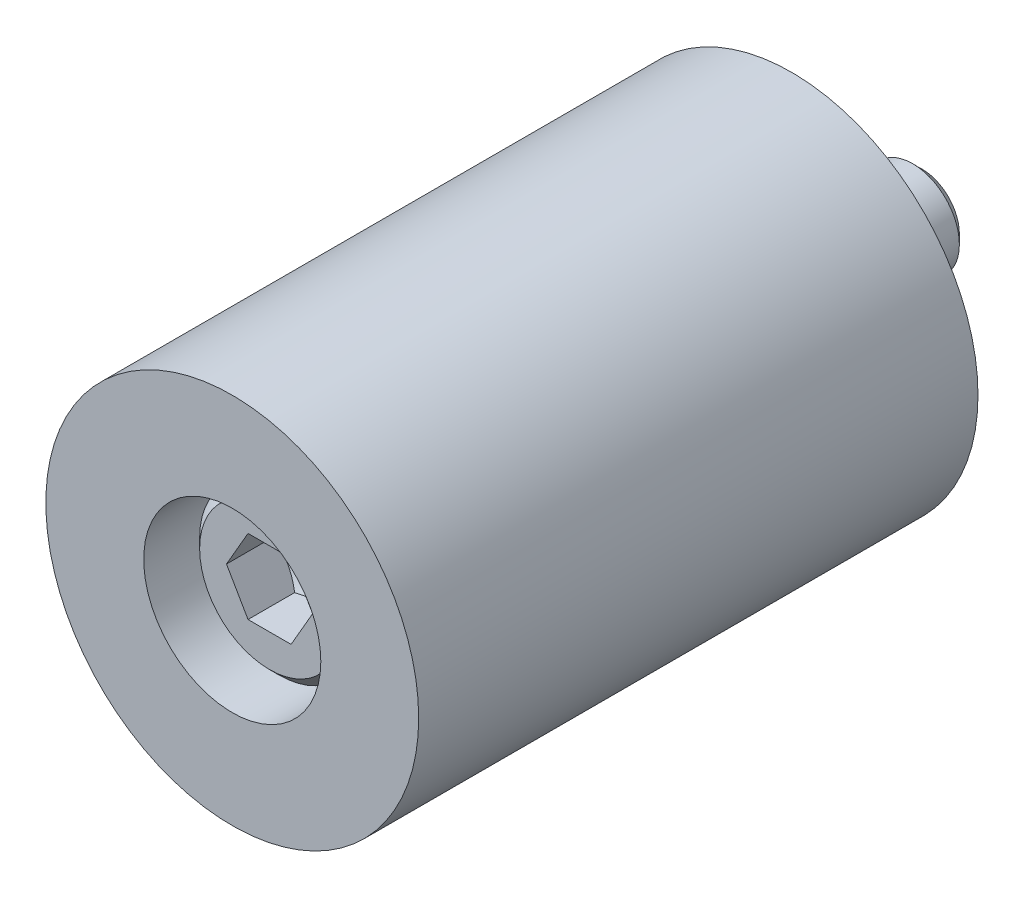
ISO-10303-21;
HEADER;
FILE_DESCRIPTION(('STEP AP214'),'2;1');
FILE_NAME('part.step','',(''),(''),'','','');
FILE_SCHEMA(('AUTOMOTIVE_DESIGN { 1 0 10303 214 1 1 1 1 }'));
ENDSEC;
DATA;
#1=APPLICATION_CONTEXT('core data for automotive mechanical design processes');
#2=APPLICATION_PROTOCOL_DEFINITION('international standard','automotive_design',2000,#1);
#3=PRODUCT_CONTEXT('',#1,'mechanical');
#4=PRODUCT('Part','Part','',(#3));
#5=PRODUCT_RELATED_PRODUCT_CATEGORY('part','',(#4));
#6=PRODUCT_DEFINITION_FORMATION('','',#4);
#7=PRODUCT_DEFINITION_CONTEXT('part definition',#1,'design');
#8=PRODUCT_DEFINITION('design','',#6,#7);
#9=PRODUCT_DEFINITION_SHAPE('','',#8);
#10=(LENGTH_UNIT() NAMED_UNIT(*) SI_UNIT(.MILLI.,.METRE.));
#11=(NAMED_UNIT(*) PLANE_ANGLE_UNIT() SI_UNIT($,.RADIAN.));
#12=(NAMED_UNIT(*) SI_UNIT($,.STERADIAN.) SOLID_ANGLE_UNIT());
#13=UNCERTAINTY_MEASURE_WITH_UNIT(LENGTH_MEASURE(1.E-05),#10,'distance_accuracy_value','');
#14=(GEOMETRIC_REPRESENTATION_CONTEXT(3) GLOBAL_UNCERTAINTY_ASSIGNED_CONTEXT((#13)) GLOBAL_UNIT_ASSIGNED_CONTEXT((#10,
#11,#12)) REPRESENTATION_CONTEXT('',''));
#15=CARTESIAN_POINT('',(0.,0.,0.));
#16=DIRECTION('',(0.,0.,1.));
#17=DIRECTION('',(1.,0.,0.));
#18=AXIS2_PLACEMENT_3D('',#15,#16,#17);
#19=CARTESIAN_POINT('',(0.,0.,15.));
#20=DIRECTION('',(0.,0.,-1.));
#21=DIRECTION('',(1.,0.,0.));
#22=AXIS2_PLACEMENT_3D('',#19,#20,#21);
#23=CYLINDRICAL_SURFACE('',#22,2.75);
#24=CARTESIAN_POINT('',(0.,0.,23.));
#25=DIRECTION('',(0.,0.,1.));
#26=DIRECTION('',(-1.,0.,0.));
#27=AXIS2_PLACEMENT_3D('',#24,#25,#26);
#28=CIRCLE('',#27,2.75);
#29=CARTESIAN_POINT('',(-2.75,0.,23.));
#30=VERTEX_POINT('',#29);
#31=CARTESIAN_POINT('',(2.75,0.,23.));
#32=VERTEX_POINT('',#31);
#33=EDGE_CURVE('P0_E36',#30,#32,#28,.T.);
#34=ORIENTED_EDGE('',*,*,#33,.T.);
#35=CARTESIAN_POINT('',(2.75,0.,23.0000008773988));
#36=CARTESIAN_POINT('',(2.75,0.,-2.11371006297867E-06));
#37=B_SPLINE_CURVE_WITH_KNOTS('',1,(#35,#36),.UNSPECIFIED.,.F.,.F.,(2,2),(0.0833333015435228,
0.916666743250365),.UNSPECIFIED.);
#38=CARTESIAN_POINT('',(2.75,0.,0.));
#39=VERTEX_POINT('',#38);
#40=EDGE_CURVE('P0_E25',#32,#39,#37,.T.);
#41=ORIENTED_EDGE('',*,*,#40,.T.);
#42=CARTESIAN_POINT('',(0.,0.,0.));
#43=DIRECTION('',(0.,0.,1.));
#44=DIRECTION('',(1.,0.,0.));
#45=AXIS2_PLACEMENT_3D('',#42,#43,#44);
#46=CIRCLE('',#45,2.75000000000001);
#47=EDGE_CURVE('P0_E11',#39,#39,#46,.T.);
#48=ORIENTED_EDGE('',*,*,#47,.F.);
#49=ORIENTED_EDGE('',*,*,#40,.F.);
#50=CARTESIAN_POINT('',(0.,0.,23.));
#51=DIRECTION('',(0.,0.,1.));
#52=DIRECTION('',(-1.,0.,0.));
#53=AXIS2_PLACEMENT_3D('',#50,#51,#52);
#54=CIRCLE('',#53,2.75);
#55=EDGE_CURVE('P0_E51',#32,#30,#54,.T.);
#56=ORIENTED_EDGE('',*,*,#55,.T.);
#57=EDGE_LOOP('',(#34,#41,#48,#49,#56));
#58=FACE_BOUND('',#57,.T.);
#59=ADVANCED_FACE('P0_F16',(#58),#23,.F.);
#60=CARTESIAN_POINT('',(0.,0.,26.5));
#61=DIRECTION('',(0.,0.,-1.));
#62=DIRECTION('',(1.,0.,0.));
#63=AXIS2_PLACEMENT_3D('',#60,#61,#62);
#64=CYLINDRICAL_SURFACE('',#63,4.75);
#65=CARTESIAN_POINT('',(0.,0.,30.));
#66=DIRECTION('',(0.,0.,-1.));
#67=DIRECTION('',(1.,0.,0.));
#68=AXIS2_PLACEMENT_3D('',#65,#66,#67);
#69=CIRCLE('',#68,4.75);
#70=CARTESIAN_POINT('',(4.75,0.,30.));
#71=VERTEX_POINT('',#70);
#72=EDGE_CURVE('P0_E53',#71,#71,#69,.T.);
#73=ORIENTED_EDGE('',*,*,#72,.F.);
#74=CARTESIAN_POINT('',(4.75,0.,29.9999986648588));
#75=CARTESIAN_POINT('',(4.75,0.,23.0000002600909));
#76=B_SPLINE_CURVE_WITH_KNOTS('',1,(#74,#75),.UNSPECIFIED.,.F.,.F.,(2,2),(0.0833334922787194,
0.916666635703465),.UNSPECIFIED.);
#77=CARTESIAN_POINT('',(4.75,0.,23.));
#78=VERTEX_POINT('',#77);
#79=EDGE_CURVE('P0_E91',#71,#78,#76,.T.);
#80=ORIENTED_EDGE('',*,*,#79,.T.);
#81=CARTESIAN_POINT('',(0.,0.,23.));
#82=DIRECTION('',(0.,0.,-1.));
#83=DIRECTION('',(1.,0.,0.));
#84=AXIS2_PLACEMENT_3D('',#81,#82,#83);
#85=CIRCLE('',#84,4.75);
#86=EDGE_CURVE('P0_E94',#78,#78,#85,.T.);
#87=ORIENTED_EDGE('',*,*,#86,.T.);
#88=ORIENTED_EDGE('',*,*,#79,.F.);
#89=EDGE_LOOP('',(#73,#80,#87,#88));
#90=FACE_BOUND('',#89,.T.);
#91=ADVANCED_FACE('P0_F111',(#90),#64,.F.);
#92=CARTESIAN_POINT('',(-10.925,9.8726896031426,23.));
#93=DIRECTION('',(0.,0.,-1.));
#94=DIRECTION('',(1.,0.,0.));
#95=AXIS2_PLACEMENT_3D('',#92,#93,#94);
#96=PLANE('',#95);
#97=ORIENTED_EDGE('',*,*,#86,.F.);
#98=EDGE_LOOP('',(#97));
#99=FACE_BOUND('',#98,.T.);
#100=ORIENTED_EDGE('',*,*,#55,.F.);
#101=ORIENTED_EDGE('',*,*,#33,.F.);
#102=EDGE_LOOP('',(#100,#101));
#103=FACE_BOUND('',#102,.T.);
#104=ADVANCED_FACE('P0_F55',(#99,#103),#96,.F.);
#105=CARTESIAN_POINT('',(0.,0.,15.));
#106=DIRECTION('',(0.,0.,1.));
#107=DIRECTION('',(1.,0.,0.));
#108=AXIS2_PLACEMENT_3D('',#105,#106,#107);
#109=CYLINDRICAL_SURFACE('',#108,10.);
#110=CARTESIAN_POINT('',(0.,0.,0.));
#111=DIRECTION('',(0.,0.,-1.));
#112=DIRECTION('',(1.,0.,0.));
#113=AXIS2_PLACEMENT_3D('',#110,#111,#112);
#114=CIRCLE('',#113,10.);
#115=CARTESIAN_POINT('',(10.,0.,0.));
#116=VERTEX_POINT('',#115);
#117=EDGE_CURVE('P0_E85',#116,#116,#114,.T.);
#118=ORIENTED_EDGE('',*,*,#117,.F.);
#119=CARTESIAN_POINT('',(10.,0.,-1.1444331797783E-06));
#120=CARTESIAN_POINT('',(10.,0.,29.9999996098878));
#121=B_SPLINE_CURVE_WITH_KNOTS('',1,(#119,#120),.UNSPECIFIED.,.F.,.F.,(2,2),(0.0833333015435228,
0.916666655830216),.UNSPECIFIED.);
#122=CARTESIAN_POINT('',(10.,0.,30.));
#123=VERTEX_POINT('',#122);
#124=EDGE_CURVE('P0_E57',#116,#123,#121,.T.);
#125=ORIENTED_EDGE('',*,*,#124,.T.);
#126=CARTESIAN_POINT('',(0.,0.,30.));
#127=DIRECTION('',(0.,0.,1.));
#128=DIRECTION('',(1.,0.,0.));
#129=AXIS2_PLACEMENT_3D('',#126,#127,#128);
#130=CIRCLE('',#129,10.);
#131=EDGE_CURVE('P0_E82',#123,#123,#130,.T.);
#132=ORIENTED_EDGE('',*,*,#131,.F.);
#133=ORIENTED_EDGE('',*,*,#124,.F.);
#134=EDGE_LOOP('',(#118,#125,#132,#133));
#135=FACE_BOUND('',#134,.T.);
#136=ADVANCED_FACE('P0_F130',(#135),#109,.T.);
#137=CARTESIAN_POINT('',(13.,-20.7846096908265,0.));
#138=DIRECTION('',(0.,0.,-1.));
#139=DIRECTION('',(-1.,0.,0.));
#140=AXIS2_PLACEMENT_3D('',#137,#138,#139);
#141=PLANE('',#140);
#142=ORIENTED_EDGE('',*,*,#117,.T.);
#143=EDGE_LOOP('',(#142));
#144=FACE_BOUND('',#143,.T.);
#145=ORIENTED_EDGE('',*,*,#47,.T.);
#146=EDGE_LOOP('',(#145));
#147=FACE_BOUND('',#146,.T.);
#148=ADVANCED_FACE('P0_F132',(#144,#147),#141,.T.);
#149=CARTESIAN_POINT('',(-23.,-20.7846096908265,30.));
#150=DIRECTION('',(0.,0.,1.));
#151=DIRECTION('',(1.,0.,0.));
#152=AXIS2_PLACEMENT_3D('',#149,#150,#151);
#153=PLANE('',#152);
#154=ORIENTED_EDGE('',*,*,#131,.T.);
#155=EDGE_LOOP('',(#154));
#156=FACE_BOUND('',#155,.T.);
#157=ORIENTED_EDGE('',*,*,#72,.T.);
#158=EDGE_LOOP('',(#157));
#159=FACE_BOUND('',#158,.T.);
#160=ADVANCED_FACE('P0_F108',(#156,#159),#153,.T.);
#161=CLOSED_SHELL('',(#59,#91,#104,#136,#148,#160));
#162=MANIFOLD_SOLID_BREP('P0_B1',#161);
#163=CARTESIAN_POINT('',(0.,0.,-5.46446609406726));
#164=DIRECTION('',(0.,0.,1.));
#165=DIRECTION('',(-1.,0.,0.));
#166=AXIS2_PLACEMENT_3D('',#163,#164,#165);
#167=CONICAL_SURFACE('',#166,3.53553390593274,0.785398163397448);
#168=CARTESIAN_POINT('',(0.,0.,-7.));
#169=DIRECTION('',(0.,0.,1.));
#170=DIRECTION('',(1.,0.,0.));
#171=AXIS2_PLACEMENT_3D('',#168,#169,#170);
#172=CIRCLE('',#171,2.);
#173=CARTESIAN_POINT('',(2.,0.,-7.));
#174=VERTEX_POINT('',#173);
#175=CARTESIAN_POINT('',(-2.,0.,-7.));
#176=VERTEX_POINT('',#175);
#177=EDGE_CURVE('P1_E37',#174,#176,#172,.T.);
#178=ORIENTED_EDGE('',*,*,#177,.T.);
#179=CARTESIAN_POINT('',(-1.99999946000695,0.,-7.00000053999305));
#180=CARTESIAN_POINT('',(-2.49999825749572,0.,-6.50000174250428));
#181=B_SPLINE_CURVE_WITH_KNOTS('',1,(#179,#180),.UNSPECIFIED.,.F.,.F.,(2,2),(0.56568527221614,
0.707106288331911),.UNSPECIFIED.);
#182=CARTESIAN_POINT('',(-2.5,0.,-6.5));
#183=VERTEX_POINT('',#182);
#184=EDGE_CURVE('P1_E24',#176,#183,#181,.T.);
#185=ORIENTED_EDGE('',*,*,#184,.T.);
#186=CARTESIAN_POINT('',(0.,0.,-6.5));
#187=DIRECTION('',(0.,0.,-1.));
#188=DIRECTION('',(1.,0.,0.));
#189=AXIS2_PLACEMENT_3D('',#186,#187,#188);
#190=CIRCLE('',#189,2.5);
#191=CARTESIAN_POINT('',(2.5,0.,-6.5));
#192=VERTEX_POINT('',#191);
#193=EDGE_CURVE('P1_E173',#183,#192,#190,.T.);
#194=ORIENTED_EDGE('',*,*,#193,.T.);
#195=CARTESIAN_POINT('',(0.,0.,-6.5));
#196=DIRECTION('',(0.,0.,-1.));
#197=DIRECTION('',(1.,0.,0.));
#198=AXIS2_PLACEMENT_3D('',#195,#196,#197);
#199=CIRCLE('',#198,2.5);
#200=EDGE_CURVE('P1_E10',#192,#183,#199,.T.);
#201=ORIENTED_EDGE('',*,*,#200,.T.);
#202=ORIENTED_EDGE('',*,*,#184,.F.);
#203=CARTESIAN_POINT('',(0.,0.,-7.));
#204=DIRECTION('',(0.,0.,1.));
#205=DIRECTION('',(1.,0.,0.));
#206=AXIS2_PLACEMENT_3D('',#203,#204,#205);
#207=CIRCLE('',#206,2.);
#208=EDGE_CURVE('P1_E146',#176,#174,#207,.T.);
#209=ORIENTED_EDGE('',*,*,#208,.T.);
#210=EDGE_LOOP('',(#178,#185,#194,#201,#202,#209));
#211=FACE_BOUND('',#210,.T.);
#212=ADVANCED_FACE('P1_F15',(#211),#167,.T.);
#213=CARTESIAN_POINT('',(0.,0.,8.));
#214=DIRECTION('',(0.,0.,-1.));
#215=DIRECTION('',(1.,0.,0.));
#216=AXIS2_PLACEMENT_3D('',#213,#214,#215);
#217=CYLINDRICAL_SURFACE('',#216,2.5);
#218=CARTESIAN_POINT('',(0.,0.,23.));
#219=DIRECTION('',(0.,0.,1.));
#220=DIRECTION('',(1.,0.,0.));
#221=AXIS2_PLACEMENT_3D('',#218,#219,#220);
#222=CIRCLE('',#221,2.5);
#223=CARTESIAN_POINT('',(2.5,0.,23.));
#224=VERTEX_POINT('',#223);
#225=EDGE_CURVE('P1_E154',#224,#224,#222,.T.);
#226=ORIENTED_EDGE('',*,*,#225,.F.);
#227=CARTESIAN_POINT('',(2.5,0.,23.0000011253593));
#228=CARTESIAN_POINT('',(2.5,0.,-6.49999961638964));
#229=B_SPLINE_CURVE_WITH_KNOTS('',1,(#227,#228),.UNSPECIFIED.,.F.,.F.,(2,2),(0.0833333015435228,
0.916666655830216),.UNSPECIFIED.);
#230=EDGE_CURVE('P1_E127',#224,#192,#229,.T.);
#231=ORIENTED_EDGE('',*,*,#230,.T.);
#232=ORIENTED_EDGE('',*,*,#193,.F.);
#233=ORIENTED_EDGE('',*,*,#200,.F.);
#234=ORIENTED_EDGE('',*,*,#230,.F.);
#235=EDGE_LOOP('',(#226,#231,#232,#233,#234));
#236=FACE_BOUND('',#235,.T.);
#237=ADVANCED_FACE('P1_F337',(#236),#217,.T.);
#238=CARTESIAN_POINT('',(-4.6,4.1569219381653,-7.));
#239=DIRECTION('',(0.,0.,-1.));
#240=DIRECTION('',(1.,0.,0.));
#241=AXIS2_PLACEMENT_3D('',#238,#239,#240);
#242=PLANE('',#241);
#243=ORIENTED_EDGE('',*,*,#208,.F.);
#244=ORIENTED_EDGE('',*,*,#177,.F.);
#245=EDGE_LOOP('',(#243,#244));
#246=FACE_BOUND('',#245,.T.);
#247=ADVANCED_FACE('P1_F340',(#246),#242,.T.);
#248=CARTESIAN_POINT('',(0.,0.,25.7395923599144));
#249=DIRECTION('',(0.,0.,-1.));
#250=DIRECTION('',(-1.,0.,0.));
#251=AXIS2_PLACEMENT_3D('',#248,#249,#250);
#252=CONICAL_SURFACE('',#251,6.01040764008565,0.785398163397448);
#253=CARTESIAN_POINT('',(0.,0.,28.));
#254=DIRECTION('',(0.,0.,-1.));
#255=DIRECTION('',(1.,0.,0.));
#256=AXIS2_PLACEMENT_3D('',#253,#254,#255);
#257=CIRCLE('',#256,3.75);
#258=CARTESIAN_POINT('',(3.75,0.,28.));
#259=VERTEX_POINT('',#258);
#260=CARTESIAN_POINT('',(-3.75,0.,28.));
#261=VERTEX_POINT('',#260);
#262=EDGE_CURVE('P1_E102',#259,#261,#257,.T.);
#263=ORIENTED_EDGE('',*,*,#262,.T.);
#264=CARTESIAN_POINT('',(-3.75000185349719,0.,27.9999981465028));
#265=CARTESIAN_POINT('',(-4.24999855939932,0.,27.5000014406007));
#266=B_SPLINE_CURVE_WITH_KNOTS('',1,(#264,#265),.UNSPECIFIED.,.F.,.F.,(2,2),(0.623918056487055,
0.707106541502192),.UNSPECIFIED.);
#267=CARTESIAN_POINT('',(-4.25,0.,27.5));
#268=VERTEX_POINT('',#267);
#269=EDGE_CURVE('P1_E107',#261,#268,#266,.T.);
#270=ORIENTED_EDGE('',*,*,#269,.T.);
#271=CARTESIAN_POINT('',(0.,0.,27.5));
#272=DIRECTION('',(0.,0.,1.));
#273=DIRECTION('',(1.,0.,0.));
#274=AXIS2_PLACEMENT_3D('',#271,#272,#273);
#275=CIRCLE('',#274,4.25);
#276=CARTESIAN_POINT('',(4.25,0.,27.5));
#277=VERTEX_POINT('',#276);
#278=EDGE_CURVE('P1_E117',#268,#277,#275,.T.);
#279=ORIENTED_EDGE('',*,*,#278,.T.);
#280=CARTESIAN_POINT('',(0.,0.,27.5));
#281=DIRECTION('',(0.,0.,1.));
#282=DIRECTION('',(1.,0.,0.));
#283=AXIS2_PLACEMENT_3D('',#280,#281,#282);
#284=CIRCLE('',#283,4.25);
#285=EDGE_CURVE('P1_E119',#277,#268,#284,.T.);
#286=ORIENTED_EDGE('',*,*,#285,.T.);
#287=ORIENTED_EDGE('',*,*,#269,.F.);
#288=CARTESIAN_POINT('',(0.,0.,28.));
#289=DIRECTION('',(0.,0.,-1.));
#290=DIRECTION('',(1.,0.,0.));
#291=AXIS2_PLACEMENT_3D('',#288,#289,#290);
#292=CIRCLE('',#291,3.75);
#293=EDGE_CURVE('P1_E109',#261,#259,#292,.T.);
#294=ORIENTED_EDGE('',*,*,#293,.T.);
#295=EDGE_LOOP('',(#263,#270,#279,#286,#287,#294));
#296=FACE_BOUND('',#295,.T.);
#297=ADVANCED_FACE('P1_F104',(#296),#252,.T.);
#298=CARTESIAN_POINT('',(0.,0.,25.5));
#299=DIRECTION('',(0.,0.,1.));
#300=DIRECTION('',(1.,0.,0.));
#301=AXIS2_PLACEMENT_3D('',#298,#299,#300);
#302=CYLINDRICAL_SURFACE('',#301,4.25);
#303=CARTESIAN_POINT('',(0.,0.,23.));
#304=DIRECTION('',(0.,0.,-1.));
#305=DIRECTION('',(1.,0.,0.));
#306=AXIS2_PLACEMENT_3D('',#303,#304,#305);
#307=CIRCLE('',#306,4.25);
#308=CARTESIAN_POINT('',(4.25,0.,23.));
#309=VERTEX_POINT('',#308);
#310=EDGE_CURVE('P1_E112',#309,#309,#307,.T.);
#311=ORIENTED_EDGE('',*,*,#310,.F.);
#312=CARTESIAN_POINT('',(4.25,0.,23.0000013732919));
#313=CARTESIAN_POINT('',(4.25,0.,27.5000005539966));
#314=B_SPLINE_CURVE_WITH_KNOTS('',1,(#312,#313),.UNSPECIFIED.,.F.,.F.,(2,2),(0.083333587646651,
0.916666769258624),.UNSPECIFIED.);
#315=EDGE_CURVE('P1_E317',#309,#277,#314,.T.);
#316=ORIENTED_EDGE('',*,*,#315,.T.);
#317=ORIENTED_EDGE('',*,*,#278,.F.);
#318=ORIENTED_EDGE('',*,*,#285,.F.);
#319=ORIENTED_EDGE('',*,*,#315,.F.);
#320=EDGE_LOOP('',(#311,#316,#317,#318,#319));
#321=FACE_BOUND('',#320,.T.);
#322=ADVANCED_FACE('P1_F348',(#321),#302,.T.);
#323=CARTESIAN_POINT('',(-8.625,-7.79422863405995,28.));
#324=DIRECTION('',(0.,0.,1.));
#325=DIRECTION('',(1.,0.,0.));
#326=AXIS2_PLACEMENT_3D('',#323,#324,#325);
#327=PLANE('',#326);
#328=ORIENTED_EDGE('',*,*,#293,.F.);
#329=ORIENTED_EDGE('',*,*,#262,.F.);
#330=EDGE_LOOP('',(#328,#329));
#331=FACE_BOUND('',#330,.T.);
#332=DIRECTION('',(-0.500000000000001,0.866025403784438,0.));
#333=VECTOR('',#332,1.);
#334=CARTESIAN_POINT('',(-1.15470053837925,-2.,28.));
#335=LINE('',#334,#333);
#336=CARTESIAN_POINT('',(-1.15470053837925,-2.,28.));
#337=VERTEX_POINT('',#336);
#338=CARTESIAN_POINT('',(-2.3094010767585,0.,28.));
#339=VERTEX_POINT('',#338);
#340=EDGE_CURVE('P1_E312',#337,#339,#335,.T.);
#341=ORIENTED_EDGE('',*,*,#340,.T.);
#342=DIRECTION('',(0.5,0.866025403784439,0.));
#343=VECTOR('',#342,1.);
#344=CARTESIAN_POINT('',(-2.3094010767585,0.,28.));
#345=LINE('',#344,#343);
#346=CARTESIAN_POINT('',(-1.15470053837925,2.,28.));
#347=VERTEX_POINT('',#346);
#348=EDGE_CURVE('P1_E306',#339,#347,#345,.T.);
#349=ORIENTED_EDGE('',*,*,#348,.T.);
#350=DIRECTION('',(1.,0.,0.));
#351=VECTOR('',#350,1.);
#352=CARTESIAN_POINT('',(-1.15470053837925,2.,28.));
#353=LINE('',#352,#351);
#354=CARTESIAN_POINT('',(1.15470053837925,2.,28.));
#355=VERTEX_POINT('',#354);
#356=EDGE_CURVE('P1_E300',#347,#355,#353,.T.);
#357=ORIENTED_EDGE('',*,*,#356,.T.);
#358=DIRECTION('',(0.500000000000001,-0.866025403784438,0.));
#359=VECTOR('',#358,1.);
#360=CARTESIAN_POINT('',(1.15470053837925,2.,28.));
#361=LINE('',#360,#359);
#362=CARTESIAN_POINT('',(2.3094010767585,0.,28.));
#363=VERTEX_POINT('',#362);
#364=EDGE_CURVE('P1_E294',#355,#363,#361,.T.);
#365=ORIENTED_EDGE('',*,*,#364,.T.);
#366=DIRECTION('',(-0.499999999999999,-0.866025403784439,0.));
#367=VECTOR('',#366,1.);
#368=CARTESIAN_POINT('',(2.3094010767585,0.,28.));
#369=LINE('',#368,#367);
#370=CARTESIAN_POINT('',(1.15470053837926,-2.,28.));
#371=VERTEX_POINT('',#370);
#372=EDGE_CURVE('P1_E288',#363,#371,#369,.T.);
#373=ORIENTED_EDGE('',*,*,#372,.T.);
#374=DIRECTION('',(-1.,0.,0.));
#375=VECTOR('',#374,1.);
#376=CARTESIAN_POINT('',(1.15470053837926,-2.,28.));
#377=LINE('',#376,#375);
#378=EDGE_CURVE('P1_E277',#371,#337,#377,.T.);
#379=ORIENTED_EDGE('',*,*,#378,.T.);
#380=EDGE_LOOP('',(#341,#349,#357,#365,#373,#379));
#381=FACE_BOUND('',#380,.T.);
#382=ADVANCED_FACE('P1_F114',(#331,#381),#327,.T.);
#383=CARTESIAN_POINT('',(0.,0.,25.9480313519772));
#384=DIRECTION('',(0.,0.,1.));
#385=DIRECTION('',(-1.,0.,0.));
#386=AXIS2_PLACEMENT_3D('',#383,#384,#385);
#387=CONICAL_SURFACE('',#386,3.05505046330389,1.02974425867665);
#388=CARTESIAN_POINT('',(0.,0.,24.122371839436));
#389=DIRECTION('',(0.,0.,-1.));
#390=DIRECTION('',(-1.,0.,0.));
#391=AXIS2_PLACEMENT_3D('',#388,#389,#390);
#392=CIRCLE('',#391,0.0166427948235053);
#393=CARTESIAN_POINT('',(-0.0166427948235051,0.,24.122371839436));
#394=VERTEX_POINT('',#393);
#395=EDGE_CURVE('P1_E216',#394,#394,#392,.T.);
#396=ORIENTED_EDGE('',*,*,#395,.T.);
#397=CARTESIAN_POINT('',(-0.0166459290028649,0.,24.1223737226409));
#398=CARTESIAN_POINT('',(-2.30940054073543,0.,25.4999996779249));
#399=B_SPLINE_CURVE_WITH_KNOTS('',1,(#397,#398),.UNSPECIFIED.,.F.,.F.,(2,2),
(0.00544865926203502,0.755928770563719),.UNSPECIFIED.);
#400=CARTESIAN_POINT('',(-2.3094010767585,0.,25.5));
#401=VERTEX_POINT('',#400);
#402=EDGE_CURVE('P1_E221',#394,#401,#399,.T.);
#403=ORIENTED_EDGE('',*,*,#402,.T.);
#404=CARTESIAN_POINT('',(-2.3094010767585,0.,25.5));
#405=CARTESIAN_POINT('',(-1.73205080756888,-0.999999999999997,25.153092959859));
#406=CARTESIAN_POINT('',(-1.15470053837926,-2.,25.5));
#407=(BOUNDED_CURVE() B_SPLINE_CURVE(2,(#404,#405,#406),.UNSPECIFIED.,.F.,
.F.) B_SPLINE_CURVE_WITH_KNOTS((3,3),(0.,2.33914062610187),
.UNSPECIFIED.) CURVE() GEOMETRIC_REPRESENTATION_ITEM() RATIONAL_B_SPLINE_CURVE((1.,
1.15470053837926,1.)) REPRESENTATION_ITEM(''));
#408=CARTESIAN_POINT('',(-1.15470053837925,-2.,25.5));
#409=VERTEX_POINT('',#408);
#410=EDGE_CURVE('P1_E227',#401,#409,#407,.T.);
#411=ORIENTED_EDGE('',*,*,#410,.T.);
#412=CARTESIAN_POINT('',(-1.15470053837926,-2.,25.5));
#413=CARTESIAN_POINT('',(0.,-2.,25.153092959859));
#414=CARTESIAN_POINT('',(1.15470053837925,-2.,25.5));
#415=(BOUNDED_CURVE() B_SPLINE_CURVE(2,(#412,#413,#414),.UNSPECIFIED.,.F.,
.F.) B_SPLINE_CURVE_WITH_KNOTS((3,3),(0.,2.33914062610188),
.UNSPECIFIED.) CURVE() GEOMETRIC_REPRESENTATION_ITEM() RATIONAL_B_SPLINE_CURVE((1.,
1.15470053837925,1.)) REPRESENTATION_ITEM(''));
#416=CARTESIAN_POINT('',(1.15470053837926,-2.,25.5));
#417=VERTEX_POINT('',#416);
#418=EDGE_CURVE('P1_E224',#409,#417,#415,.T.);
#419=ORIENTED_EDGE('',*,*,#418,.T.);
#420=CARTESIAN_POINT('',(1.15470053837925,-2.,25.5));
#421=CARTESIAN_POINT('',(1.73205080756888,-1.,25.153092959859));
#422=CARTESIAN_POINT('',(2.3094010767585,0.,25.5));
#423=(BOUNDED_CURVE() B_SPLINE_CURVE(2,(#420,#421,#422),.UNSPECIFIED.,.F.,
.F.) B_SPLINE_CURVE_WITH_KNOTS((3,3),(0.,2.33914062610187),
.UNSPECIFIED.) CURVE() GEOMETRIC_REPRESENTATION_ITEM() RATIONAL_B_SPLINE_CURVE((1.,
1.15470053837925,1.)) REPRESENTATION_ITEM(''));
#424=CARTESIAN_POINT('',(2.3094010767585,0.,25.5));
#425=VERTEX_POINT('',#424);
#426=EDGE_CURVE('P1_E267',#417,#425,#423,.T.);
#427=ORIENTED_EDGE('',*,*,#426,.T.);
#428=CARTESIAN_POINT('',(2.3094010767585,0.,25.5));
#429=CARTESIAN_POINT('',(1.73205080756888,0.999999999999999,25.153092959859));
#430=CARTESIAN_POINT('',(1.15470053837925,2.,25.5));
#431=(BOUNDED_CURVE() B_SPLINE_CURVE(2,(#428,#429,#430),.UNSPECIFIED.,.F.,
.F.) B_SPLINE_CURVE_WITH_KNOTS((3,3),(0.,2.33914062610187),
.UNSPECIFIED.) CURVE() GEOMETRIC_REPRESENTATION_ITEM() RATIONAL_B_SPLINE_CURVE((1.,
1.15470053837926,1.)) REPRESENTATION_ITEM(''));
#432=CARTESIAN_POINT('',(1.15470053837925,2.,25.5));
#433=VERTEX_POINT('',#432);
#434=EDGE_CURVE('P1_E257',#425,#433,#431,.T.);
#435=ORIENTED_EDGE('',*,*,#434,.T.);
#436=CARTESIAN_POINT('',(1.15470053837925,2.,25.5));
#437=CARTESIAN_POINT('',(0.,2.,25.153092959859));
#438=CARTESIAN_POINT('',(-1.15470053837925,2.,25.5));
#439=(BOUNDED_CURVE() B_SPLINE_CURVE(2,(#436,#437,#438),.UNSPECIFIED.,.F.,
.F.) B_SPLINE_CURVE_WITH_KNOTS((3,3),(0.,2.33914062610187),
.UNSPECIFIED.) CURVE() GEOMETRIC_REPRESENTATION_ITEM() RATIONAL_B_SPLINE_CURVE((1.,
1.15470053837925,1.)) REPRESENTATION_ITEM(''));
#440=CARTESIAN_POINT('',(-1.15470053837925,2.,25.5));
#441=VERTEX_POINT('',#440);
#442=EDGE_CURVE('P1_E247',#433,#441,#439,.T.);
#443=ORIENTED_EDGE('',*,*,#442,.T.);
#444=CARTESIAN_POINT('',(-1.15470053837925,2.,25.5));
#445=CARTESIAN_POINT('',(-1.73205080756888,1.,25.153092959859));
#446=CARTESIAN_POINT('',(-2.3094010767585,0.,25.5));
#447=(BOUNDED_CURVE() B_SPLINE_CURVE(2,(#444,#445,#446),.UNSPECIFIED.,.F.,
.F.) B_SPLINE_CURVE_WITH_KNOTS((3,3),(0.,2.33914062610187),
.UNSPECIFIED.) CURVE() GEOMETRIC_REPRESENTATION_ITEM() RATIONAL_B_SPLINE_CURVE((1.,
1.15470053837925,1.)) REPRESENTATION_ITEM(''));
#448=EDGE_CURVE('P1_E237',#441,#401,#447,.T.);
#449=ORIENTED_EDGE('',*,*,#448,.T.);
#450=ORIENTED_EDGE('',*,*,#402,.F.);
#451=EDGE_LOOP('',(#396,#403,#411,#419,#427,#435,#443,#449,#450));
#452=FACE_BOUND('',#451,.T.);
#453=ADVANCED_FACE('P1_F390',(#452),#387,.F.);
#454=CARTESIAN_POINT('',(0.0382784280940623,-0.0345913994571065,24.122371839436));
#455=DIRECTION('',(0.,0.,-1.));
#456=DIRECTION('',(-1.,0.,0.));
#457=AXIS2_PLACEMENT_3D('',#454,#455,#456);
#458=PLANE('',#457);
#459=ORIENTED_EDGE('',*,*,#395,.F.);
#460=EDGE_LOOP('',(#459));
#461=FACE_BOUND('',#460,.T.);
#462=ADVANCED_FACE('P1_F398',(#461),#458,.F.);
#463=CARTESIAN_POINT('',(-1.03923048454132,-2.2,28.2846907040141));
#464=DIRECTION('',(-0.866025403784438,-0.500000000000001,0.));
#465=DIRECTION('',(-0.500000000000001,0.866025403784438,0.));
#466=AXIS2_PLACEMENT_3D('',#463,#464,#465);
#467=PLANE('',#466);
#468=DIRECTION('',(0.,0.,-1.));
#469=VECTOR('',#468,1.);
#470=CARTESIAN_POINT('',(-2.3094010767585,0.,28.));
#471=LINE('',#470,#469);
#472=EDGE_CURVE('P1_E210',#339,#401,#471,.T.);
#473=ORIENTED_EDGE('',*,*,#472,.F.);
#474=ORIENTED_EDGE('',*,*,#340,.F.);
#475=DIRECTION('',(0.,0.,-1.));
#476=VECTOR('',#475,1.);
#477=CARTESIAN_POINT('',(-1.15470053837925,-2.,28.));
#478=LINE('',#477,#476);
#479=EDGE_CURVE('P1_E204',#337,#409,#478,.T.);
#480=ORIENTED_EDGE('',*,*,#479,.T.);
#481=ORIENTED_EDGE('',*,*,#410,.F.);
#482=EDGE_LOOP('',(#473,#474,#480,#481));
#483=FACE_BOUND('',#482,.T.);
#484=ADVANCED_FACE('P1_F407',(#483),#467,.F.);
#485=CARTESIAN_POINT('',(1.38564064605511,-2.,28.2846907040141));
#486=DIRECTION('',(0.,-1.,0.));
#487=DIRECTION('',(-1.,0.,0.));
#488=AXIS2_PLACEMENT_3D('',#485,#486,#487);
#489=PLANE('',#488);
#490=ORIENTED_EDGE('',*,*,#479,.F.);
#491=ORIENTED_EDGE('',*,*,#378,.F.);
#492=DIRECTION('',(0.,0.,-1.));
#493=VECTOR('',#492,1.);
#494=CARTESIAN_POINT('',(1.15470053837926,-2.,28.));
#495=LINE('',#494,#493);
#496=EDGE_CURVE('P1_E198',#371,#417,#495,.T.);
#497=ORIENTED_EDGE('',*,*,#496,.T.);
#498=ORIENTED_EDGE('',*,*,#418,.F.);
#499=EDGE_LOOP('',(#490,#491,#497,#498));
#500=FACE_BOUND('',#499,.T.);
#501=ADVANCED_FACE('P1_F416',(#500),#489,.F.);
#502=CARTESIAN_POINT('',(2.42487113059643,0.200000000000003,28.2846907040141));
#503=DIRECTION('',(0.866025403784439,-0.499999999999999,0.));
#504=DIRECTION('',(-0.499999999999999,-0.866025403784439,0.));
#505=AXIS2_PLACEMENT_3D('',#502,#503,#504);
#506=PLANE('',#505);
#507=ORIENTED_EDGE('',*,*,#496,.F.);
#508=ORIENTED_EDGE('',*,*,#372,.F.);
#509=DIRECTION('',(0.,0.,-1.));
#510=VECTOR('',#509,1.);
#511=CARTESIAN_POINT('',(2.3094010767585,0.,28.));
#512=LINE('',#511,#510);
#513=EDGE_CURVE('P1_E192',#363,#425,#512,.T.);
#514=ORIENTED_EDGE('',*,*,#513,.T.);
#515=ORIENTED_EDGE('',*,*,#426,.F.);
#516=EDGE_LOOP('',(#507,#508,#514,#515));
#517=FACE_BOUND('',#516,.T.);
#518=ADVANCED_FACE('P1_F425',(#517),#506,.F.);
#519=CARTESIAN_POINT('',(1.03923048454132,2.2,28.2846907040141));
#520=DIRECTION('',(0.866025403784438,0.500000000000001,0.));
#521=DIRECTION('',(0.500000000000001,-0.866025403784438,0.));
#522=AXIS2_PLACEMENT_3D('',#519,#520,#521);
#523=PLANE('',#522);
#524=ORIENTED_EDGE('',*,*,#513,.F.);
#525=ORIENTED_EDGE('',*,*,#364,.F.);
#526=DIRECTION('',(0.,0.,-1.));
#527=VECTOR('',#526,1.);
#528=CARTESIAN_POINT('',(1.15470053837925,2.,28.));
#529=LINE('',#528,#527);
#530=EDGE_CURVE('P1_E186',#355,#433,#529,.T.);
#531=ORIENTED_EDGE('',*,*,#530,.T.);
#532=ORIENTED_EDGE('',*,*,#434,.F.);
#533=EDGE_LOOP('',(#524,#525,#531,#532));
#534=FACE_BOUND('',#533,.T.);
#535=ADVANCED_FACE('P1_F434',(#534),#523,.F.);
#536=CARTESIAN_POINT('',(-1.3856406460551,2.,28.2846907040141));
#537=DIRECTION('',(0.,1.,0.));
#538=DIRECTION('',(1.,0.,0.));
#539=AXIS2_PLACEMENT_3D('',#536,#537,#538);
#540=PLANE('',#539);
#541=ORIENTED_EDGE('',*,*,#530,.F.);
#542=ORIENTED_EDGE('',*,*,#356,.F.);
#543=DIRECTION('',(0.,0.,-1.));
#544=VECTOR('',#543,1.);
#545=CARTESIAN_POINT('',(-1.15470053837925,2.,28.));
#546=LINE('',#545,#544);
#547=EDGE_CURVE('P1_E178',#347,#441,#546,.T.);
#548=ORIENTED_EDGE('',*,*,#547,.T.);
#549=ORIENTED_EDGE('',*,*,#442,.F.);
#550=EDGE_LOOP('',(#541,#542,#548,#549));
#551=FACE_BOUND('',#550,.T.);
#552=ADVANCED_FACE('P1_F443',(#551),#540,.F.);
#553=CARTESIAN_POINT('',(-2.42487113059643,-0.200000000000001,28.2846907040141));
#554=DIRECTION('',(-0.866025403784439,0.5,0.));
#555=DIRECTION('',(0.5,0.866025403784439,0.));
#556=AXIS2_PLACEMENT_3D('',#553,#554,#555);
#557=PLANE('',#556);
#558=ORIENTED_EDGE('',*,*,#547,.F.);
#559=ORIENTED_EDGE('',*,*,#348,.F.);
#560=ORIENTED_EDGE('',*,*,#472,.T.);
#561=ORIENTED_EDGE('',*,*,#448,.F.);
#562=EDGE_LOOP('',(#558,#559,#560,#561));
#563=FACE_BOUND('',#562,.T.);
#564=ADVANCED_FACE('P1_F452',(#563),#557,.F.);
#565=CARTESIAN_POINT('',(5.525,-8.83345911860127,23.));
#566=DIRECTION('',(0.,0.,-1.));
#567=DIRECTION('',(-1.,0.,0.));
#568=AXIS2_PLACEMENT_3D('',#565,#566,#567);
#569=PLANE('',#568);
#570=ORIENTED_EDGE('',*,*,#310,.T.);
#571=EDGE_LOOP('',(#570));
#572=FACE_BOUND('',#571,.T.);
#573=ORIENTED_EDGE('',*,*,#225,.T.);
#574=EDGE_LOOP('',(#573));
#575=FACE_BOUND('',#574,.T.);
#576=ADVANCED_FACE('P1_F336',(#572,#575),#569,.T.);
#577=CLOSED_SHELL('',(#212,#237,#247,#297,#322,#382,#453,#462,#484,#501,#518,#535,#552,#564,#576));
#578=MANIFOLD_SOLID_BREP('P1_B1',#577);
#579=ADVANCED_BREP_SHAPE_REPRESENTATION('',(#18,#162,#578),#14);
#580=SHAPE_DEFINITION_REPRESENTATION(#9,#579);
ENDSEC;
END-ISO-10303-21;
